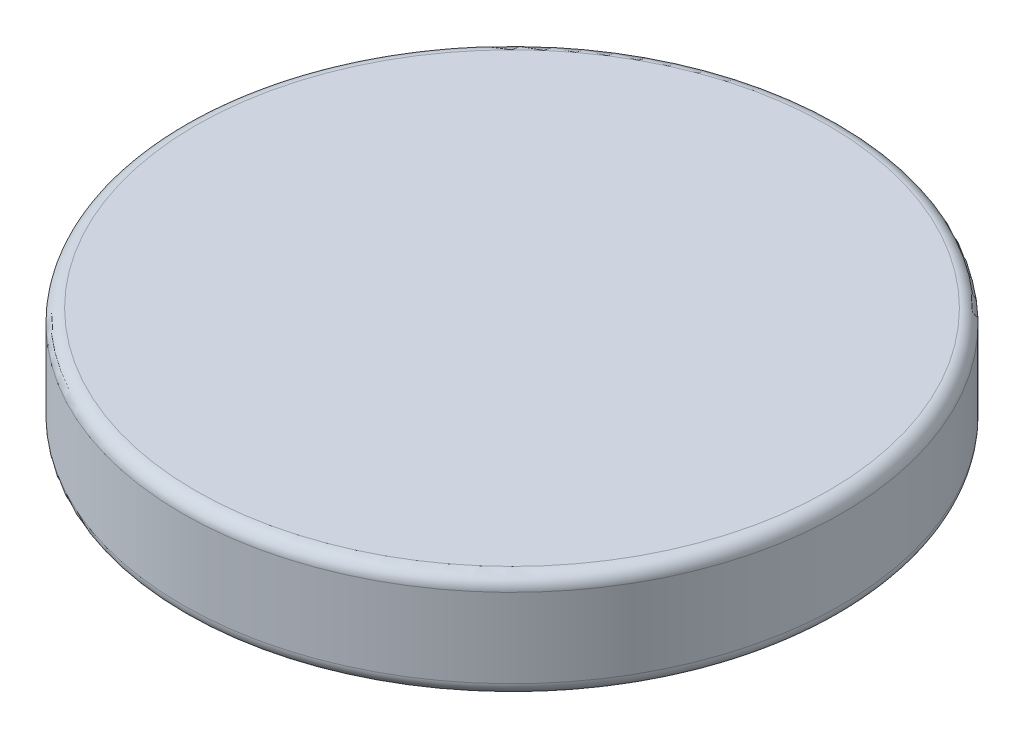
ISO-10303-21;
HEADER;
FILE_DESCRIPTION(('STEP AP214'),'2;1');
FILE_NAME('part.step','',(''),(''),'','','');
FILE_SCHEMA(('AUTOMOTIVE_DESIGN { 1 0 10303 214 1 1 1 1 }'));
ENDSEC;
DATA;
#1=APPLICATION_CONTEXT('core data for automotive mechanical design processes');
#2=APPLICATION_PROTOCOL_DEFINITION('international standard','automotive_design',2000,#1);
#3=PRODUCT_CONTEXT('',#1,'mechanical');
#4=PRODUCT('Part','Part','',(#3));
#5=PRODUCT_RELATED_PRODUCT_CATEGORY('part','',(#4));
#6=PRODUCT_DEFINITION_FORMATION('','',#4);
#7=PRODUCT_DEFINITION_CONTEXT('part definition',#1,'design');
#8=PRODUCT_DEFINITION('design','',#6,#7);
#9=PRODUCT_DEFINITION_SHAPE('','',#8);
#10=(LENGTH_UNIT() NAMED_UNIT(*) SI_UNIT(.MILLI.,.METRE.));
#11=(NAMED_UNIT(*) PLANE_ANGLE_UNIT() SI_UNIT($,.RADIAN.));
#12=(NAMED_UNIT(*) SI_UNIT($,.STERADIAN.) SOLID_ANGLE_UNIT());
#13=UNCERTAINTY_MEASURE_WITH_UNIT(LENGTH_MEASURE(1.E-05),#10,'distance_accuracy_value','');
#14=(GEOMETRIC_REPRESENTATION_CONTEXT(3) GLOBAL_UNCERTAINTY_ASSIGNED_CONTEXT((#13)) GLOBAL_UNIT_ASSIGNED_CONTEXT((#10,
#11,#12)) REPRESENTATION_CONTEXT('',''));
#15=CARTESIAN_POINT('',(0.,0.,0.));
#16=DIRECTION('',(0.,0.,1.));
#17=DIRECTION('',(1.,0.,0.));
#18=AXIS2_PLACEMENT_3D('',#15,#16,#17);
#19=CARTESIAN_POINT('',(0.,4.,0.));
#20=DIRECTION('',(0.,-1.,0.));
#21=DIRECTION('',(0.,0.,-1.));
#22=AXIS2_PLACEMENT_3D('',#19,#20,#21);
#23=CYLINDRICAL_SURFACE('',#22,12.5);
#24=CARTESIAN_POINT('',(0.,0.5,0.));
#25=DIRECTION('',(0.,1.,0.));
#26=DIRECTION('',(0.,0.,1.));
#27=AXIS2_PLACEMENT_3D('',#24,#25,#26);
#28=CIRCLE('',#27,12.5);
#29=CARTESIAN_POINT('',(0.,0.5,12.5));
#30=VERTEX_POINT('',#29);
#31=EDGE_CURVE('E37',#30,#30,#28,.T.);
#32=ORIENTED_EDGE('',*,*,#31,.T.);
#33=EDGE_LOOP('',(#32));
#34=FACE_BOUND('',#33,.T.);
#35=CARTESIAN_POINT('',(0.,3.5,0.));
#36=DIRECTION('',(0.,1.,0.));
#37=DIRECTION('',(0.,0.,1.));
#38=AXIS2_PLACEMENT_3D('',#35,#36,#37);
#39=CIRCLE('',#38,12.5);
#40=CARTESIAN_POINT('',(0.,3.5,12.5));
#41=VERTEX_POINT('',#40);
#42=EDGE_CURVE('E41',#41,#41,#39,.F.);
#43=ORIENTED_EDGE('',*,*,#42,.T.);
#44=EDGE_LOOP('',(#43));
#45=FACE_BOUND('',#44,.T.);
#46=ADVANCED_FACE('F30',(#34,#45),#23,.T.);
#47=CARTESIAN_POINT('',(0.,4.,0.));
#48=DIRECTION('',(0.,1.,0.));
#49=DIRECTION('',(0.,0.,1.));
#50=AXIS2_PLACEMENT_3D('',#47,#48,#49);
#51=PLANE('',#50);
#52=CARTESIAN_POINT('',(0.,4.,0.));
#53=DIRECTION('',(0.,1.,0.));
#54=DIRECTION('',(0.,0.,1.));
#55=AXIS2_PLACEMENT_3D('',#52,#53,#54);
#56=CIRCLE('',#55,12.);
#57=CARTESIAN_POINT('',(0.,4.,12.));
#58=VERTEX_POINT('',#57);
#59=EDGE_CURVE('E45',#58,#58,#56,.T.);
#60=ORIENTED_EDGE('',*,*,#59,.T.);
#61=EDGE_LOOP('',(#60));
#62=FACE_BOUND('',#61,.T.);
#63=ADVANCED_FACE('F51',(#62),#51,.T.);
#64=CARTESIAN_POINT('',(0.,0.,0.));
#65=DIRECTION('',(0.,1.,0.));
#66=DIRECTION('',(0.,0.,1.));
#67=AXIS2_PLACEMENT_3D('',#64,#65,#66);
#68=PLANE('',#67);
#69=CARTESIAN_POINT('',(0.,0.,0.));
#70=DIRECTION('',(0.,1.,0.));
#71=DIRECTION('',(0.,0.,1.));
#72=AXIS2_PLACEMENT_3D('',#69,#70,#71);
#73=CIRCLE('',#72,12.);
#74=CARTESIAN_POINT('',(0.,0.,12.));
#75=VERTEX_POINT('',#74);
#76=EDGE_CURVE('E10',#75,#75,#73,.F.);
#77=ORIENTED_EDGE('',*,*,#76,.T.);
#78=EDGE_LOOP('',(#77));
#79=FACE_BOUND('',#78,.T.);
#80=ADVANCED_FACE('F55',(#79),#68,.F.);
#81=CARTESIAN_POINT('',(0.,3.5,0.));
#82=DIRECTION('',(0.,1.,0.));
#83=DIRECTION('',(0.,0.,1.));
#84=AXIS2_PLACEMENT_3D('',#81,#82,#83);
#85=TOROIDAL_SURFACE('',#84,12.,0.5);
#86=ORIENTED_EDGE('',*,*,#42,.F.);
#87=EDGE_LOOP('',(#86));
#88=FACE_BOUND('',#87,.T.);
#89=ORIENTED_EDGE('',*,*,#59,.F.);
#90=EDGE_LOOP('',(#89));
#91=FACE_BOUND('',#90,.T.);
#92=ADVANCED_FACE('F53',(#88,#91),#85,.T.);
#93=CARTESIAN_POINT('',(0.,0.5,0.));
#94=DIRECTION('',(0.,1.,0.));
#95=DIRECTION('',(0.,0.,1.));
#96=AXIS2_PLACEMENT_3D('',#93,#94,#95);
#97=TOROIDAL_SURFACE('',#96,12.,0.5);
#98=ORIENTED_EDGE('',*,*,#76,.F.);
#99=EDGE_LOOP('',(#98));
#100=FACE_BOUND('',#99,.T.);
#101=ORIENTED_EDGE('',*,*,#31,.F.);
#102=EDGE_LOOP('',(#101));
#103=FACE_BOUND('',#102,.T.);
#104=ADVANCED_FACE('F32',(#100,#103),#97,.T.);
#105=CLOSED_SHELL('',(#46,#63,#80,#92,#104));
#106=MANIFOLD_SOLID_BREP('B2',#105);
#107=ADVANCED_BREP_SHAPE_REPRESENTATION('',(#18,#106),#14);
#108=SHAPE_DEFINITION_REPRESENTATION(#9,#107);
ENDSEC;
END-ISO-10303-21;
